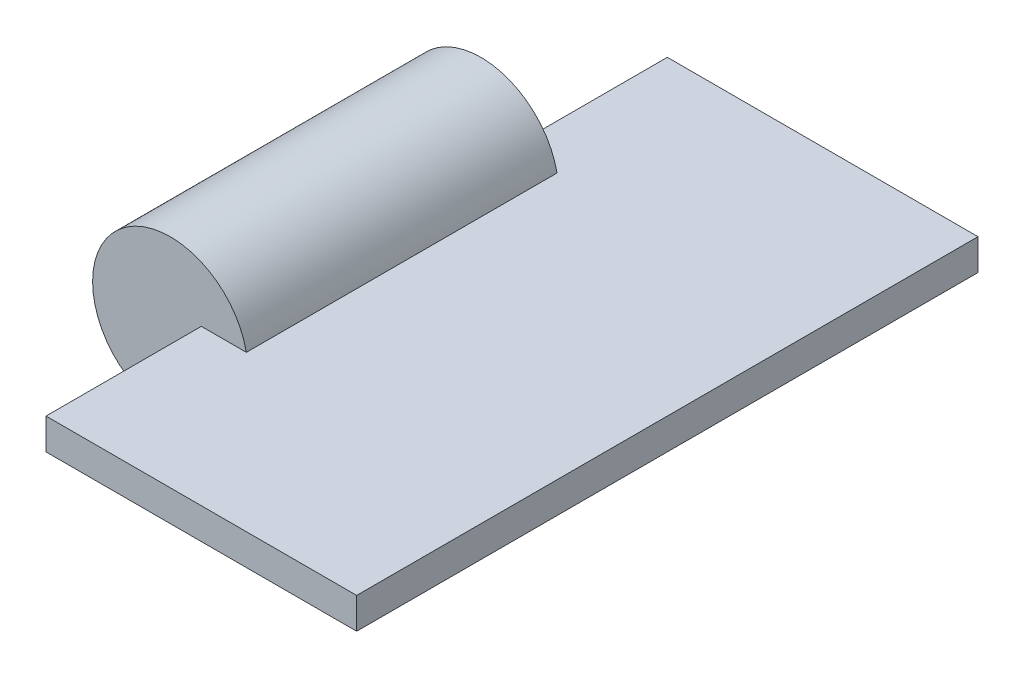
from build123d import *

# Parameters (mm, degrees)
SKETCH1_R           = 5
BOSS_EXTRUDE1_DEPTH = 20
SKETCH2_W           = 20
SKETCH2_H           = 40
BOSS_EXTRUDE2_DEPTH = 1


with BuildPart() as part:
    # Sketch1 → Boss-Extrude1 (new body)
    with BuildSketch(Plane.XY):
        Circle(SKETCH1_R)
    extrude(amount=BOSS_EXTRUDE1_DEPTH)

    # Sketch2 → Boss-Extrude2 (add, symmetric)
    with BuildSketch(Plane(origin=(0, 0, 0), x_dir=(1, 0, 0), z_dir=(0, 1, 0))):
        with Locations((12, -10)):
            Rectangle(SKETCH2_W, SKETCH2_H)
    extrude(amount=BOSS_EXTRUDE2_DEPTH, both=True)


solid = part.part
